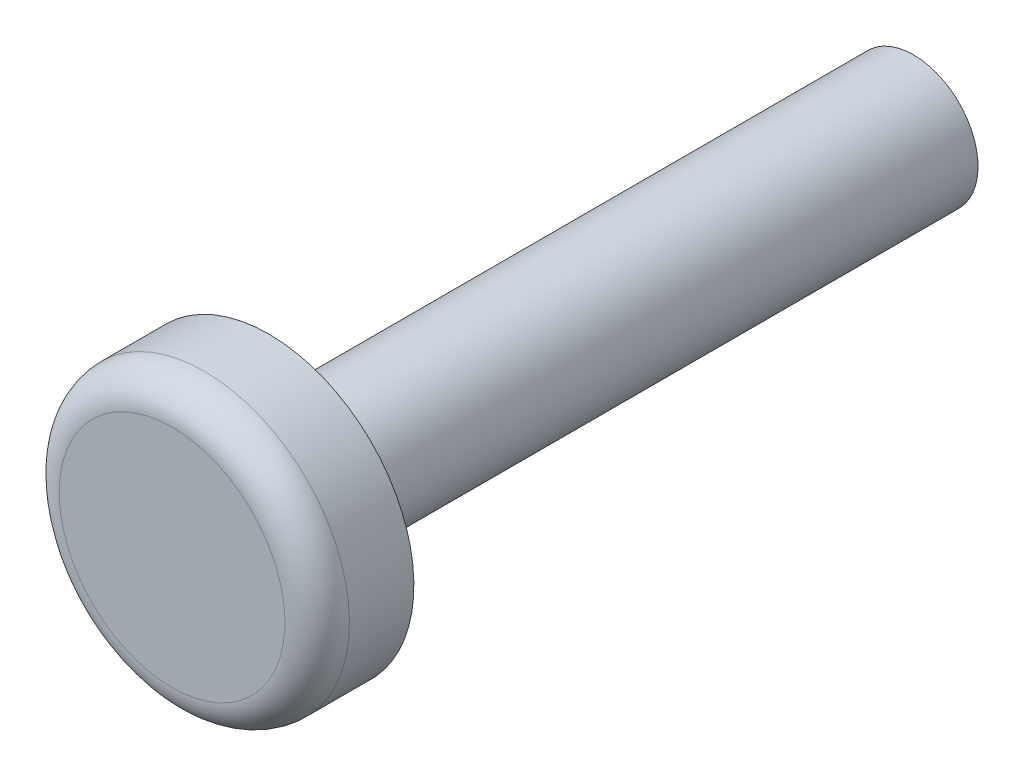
ISO-10303-21;
HEADER;
FILE_DESCRIPTION(('STEP AP214'),'2;1');
FILE_NAME('part.step','',(''),(''),'','','');
FILE_SCHEMA(('AUTOMOTIVE_DESIGN { 1 0 10303 214 1 1 1 1 }'));
ENDSEC;
DATA;
#1=APPLICATION_CONTEXT('core data for automotive mechanical design processes');
#2=APPLICATION_PROTOCOL_DEFINITION('international standard','automotive_design',2000,#1);
#3=PRODUCT_CONTEXT('',#1,'mechanical');
#4=PRODUCT('Part','Part','',(#3));
#5=PRODUCT_RELATED_PRODUCT_CATEGORY('part','',(#4));
#6=PRODUCT_DEFINITION_FORMATION('','',#4);
#7=PRODUCT_DEFINITION_CONTEXT('part definition',#1,'design');
#8=PRODUCT_DEFINITION('design','',#6,#7);
#9=PRODUCT_DEFINITION_SHAPE('','',#8);
#10=(LENGTH_UNIT() NAMED_UNIT(*) SI_UNIT(.MILLI.,.METRE.));
#11=(NAMED_UNIT(*) PLANE_ANGLE_UNIT() SI_UNIT($,.RADIAN.));
#12=(NAMED_UNIT(*) SI_UNIT($,.STERADIAN.) SOLID_ANGLE_UNIT());
#13=UNCERTAINTY_MEASURE_WITH_UNIT(LENGTH_MEASURE(1.E-05),#10,'distance_accuracy_value','');
#14=(GEOMETRIC_REPRESENTATION_CONTEXT(3) GLOBAL_UNCERTAINTY_ASSIGNED_CONTEXT((#13)) GLOBAL_UNIT_ASSIGNED_CONTEXT((#10,
#11,#12)) REPRESENTATION_CONTEXT('',''));
#15=CARTESIAN_POINT('',(0.,0.,0.));
#16=DIRECTION('',(0.,0.,1.));
#17=DIRECTION('',(1.,0.,0.));
#18=AXIS2_PLACEMENT_3D('',#15,#16,#17);
#19=CARTESIAN_POINT('',(0.,0.,-23.9972467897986));
#20=DIRECTION('',(0.,0.,-1.));
#21=DIRECTION('',(0.,1.,0.));
#22=AXIS2_PLACEMENT_3D('',#19,#20,#21);
#23=CYLINDRICAL_SURFACE('',#22,2.);
#24=CARTESIAN_POINT('',(0.,0.,-2.99724678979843));
#25=DIRECTION('',(0.,0.,-1.));
#26=DIRECTION('',(0.,1.,0.));
#27=AXIS2_PLACEMENT_3D('',#24,#25,#26);
#28=CIRCLE('',#27,2.);
#29=CARTESIAN_POINT('',(0.,2.00000000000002,-2.99724678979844));
#30=VERTEX_POINT('',#29);
#31=EDGE_CURVE('E9',#30,#30,#28,.T.);
#32=ORIENTED_EDGE('',*,*,#31,.T.);
#33=EDGE_LOOP('',(#32));
#34=FACE_BOUND('',#33,.T.);
#35=CARTESIAN_POINT('',(0.,0.,-22.9972467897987));
#36=DIRECTION('',(0.,0.,-1.));
#37=DIRECTION('',(0.,1.,0.));
#38=AXIS2_PLACEMENT_3D('',#35,#36,#37);
#39=CIRCLE('',#38,2.);
#40=CARTESIAN_POINT('',(0.,1.99999999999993,-22.9972467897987));
#41=VERTEX_POINT('',#40);
#42=EDGE_CURVE('E43',#41,#41,#39,.T.);
#43=ORIENTED_EDGE('',*,*,#42,.F.);
#44=EDGE_LOOP('',(#43));
#45=FACE_BOUND('',#44,.T.);
#46=ADVANCED_FACE('F14',(#34,#45),#23,.T.);
#47=CARTESIAN_POINT('',(0.,-4.5,0.00275321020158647));
#48=DIRECTION('',(0.,0.,-1.));
#49=DIRECTION('',(0.,1.,0.));
#50=AXIS2_PLACEMENT_3D('',#47,#48,#49);
#51=PLANE('',#50);
#52=CARTESIAN_POINT('',(0.,0.,0.00275321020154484));
#53=DIRECTION('',(0.,0.,-1.));
#54=DIRECTION('',(0.,1.,0.));
#55=AXIS2_PLACEMENT_3D('',#52,#53,#54);
#56=CIRCLE('',#55,3.49999999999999);
#57=CARTESIAN_POINT('',(0.,3.5,0.0027532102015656));
#58=VERTEX_POINT('',#57);
#59=CARTESIAN_POINT('',(0.,-3.5,0.00275321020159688));
#60=VERTEX_POINT('',#59);
#61=EDGE_CURVE('E34',#58,#60,#56,.T.);
#62=ORIENTED_EDGE('',*,*,#61,.F.);
#63=CARTESIAN_POINT('',(0.,0.,0.00275321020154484));
#64=DIRECTION('',(0.,0.,-1.));
#65=DIRECTION('',(0.,-1.,0.));
#66=AXIS2_PLACEMENT_3D('',#63,#64,#65);
#67=CIRCLE('',#66,3.49999999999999);
#68=EDGE_CURVE('E31',#60,#58,#67,.T.);
#69=ORIENTED_EDGE('',*,*,#68,.F.);
#70=EDGE_LOOP('',(#62,#69));
#71=FACE_BOUND('',#70,.T.);
#72=ADVANCED_FACE('F36',(#71),#51,.F.);
#73=CARTESIAN_POINT('',(0.,0.,-0.997246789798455));
#74=DIRECTION('',(0.,0.,-1.));
#75=DIRECTION('',(0.,1.,0.));
#76=AXIS2_PLACEMENT_3D('',#73,#74,#75);
#77=TOROIDAL_SURFACE('',#76,3.49999999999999,1.);
#78=CARTESIAN_POINT('',(0.,0.,-0.997246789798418));
#79=DIRECTION('',(0.,0.,-1.));
#80=DIRECTION('',(0.,1.,0.));
#81=AXIS2_PLACEMENT_3D('',#78,#79,#80);
#82=CIRCLE('',#81,4.5);
#83=CARTESIAN_POINT('',(0.,4.50000000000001,-0.997246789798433));
#84=VERTEX_POINT('',#83);
#85=EDGE_CURVE('E39',#84,#84,#82,.T.);
#86=ORIENTED_EDGE('',*,*,#85,.F.);
#87=EDGE_LOOP('',(#86));
#88=FACE_BOUND('',#87,.T.);
#89=ORIENTED_EDGE('',*,*,#61,.T.);
#90=ORIENTED_EDGE('',*,*,#68,.T.);
#91=EDGE_LOOP('',(#89,#90));
#92=FACE_BOUND('',#91,.T.);
#93=ADVANCED_FACE('F42',(#88,#92),#77,.T.);
#94=CARTESIAN_POINT('',(0.,0.,-23.9972467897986));
#95=DIRECTION('',(0.,0.,-1.));
#96=DIRECTION('',(0.,1.,0.));
#97=AXIS2_PLACEMENT_3D('',#94,#95,#96);
#98=CYLINDRICAL_SURFACE('',#97,4.5);
#99=CARTESIAN_POINT('',(0.,0.,-2.99724678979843));
#100=DIRECTION('',(0.,0.,-1.));
#101=DIRECTION('',(0.,1.,0.));
#102=AXIS2_PLACEMENT_3D('',#99,#100,#101);
#103=CIRCLE('',#102,4.5);
#104=CARTESIAN_POINT('',(0.,4.50000000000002,-2.99724678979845));
#105=VERTEX_POINT('',#104);
#106=EDGE_CURVE('E24',#105,#105,#103,.F.);
#107=ORIENTED_EDGE('',*,*,#106,.T.);
#108=EDGE_LOOP('',(#107));
#109=FACE_BOUND('',#108,.T.);
#110=ORIENTED_EDGE('',*,*,#85,.T.);
#111=EDGE_LOOP('',(#110));
#112=FACE_BOUND('',#111,.T.);
#113=ADVANCED_FACE('F58',(#109,#112),#98,.T.);
#114=CARTESIAN_POINT('',(0.,-2.,-2.99724678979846));
#115=DIRECTION('',(0.,0.,1.));
#116=DIRECTION('',(0.,-1.,0.));
#117=AXIS2_PLACEMENT_3D('',#114,#115,#116);
#118=PLANE('',#117);
#119=ORIENTED_EDGE('',*,*,#106,.F.);
#120=EDGE_LOOP('',(#119));
#121=FACE_BOUND('',#120,.T.);
#122=ORIENTED_EDGE('',*,*,#31,.F.);
#123=EDGE_LOOP('',(#122));
#124=FACE_BOUND('',#123,.T.);
#125=ADVANCED_FACE('F74',(#121,#124),#118,.F.);
#126=CARTESIAN_POINT('',(0.,0.,-22.9972467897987));
#127=DIRECTION('',(0.,0.,-1.));
#128=DIRECTION('',(0.,1.,0.));
#129=AXIS2_PLACEMENT_3D('',#126,#127,#128);
#130=PLANE('',#129);
#131=ORIENTED_EDGE('',*,*,#42,.T.);
#132=EDGE_LOOP('',(#131));
#133=FACE_BOUND('',#132,.T.);
#134=ADVANCED_FACE('F70',(#133),#130,.T.);
#135=CLOSED_SHELL('',(#46,#72,#93,#113,#125,#134));
#136=MANIFOLD_SOLID_BREP('B1',#135);
#137=ADVANCED_BREP_SHAPE_REPRESENTATION('',(#18,#136),#14);
#138=SHAPE_DEFINITION_REPRESENTATION(#9,#137);
ENDSEC;
END-ISO-10303-21;
